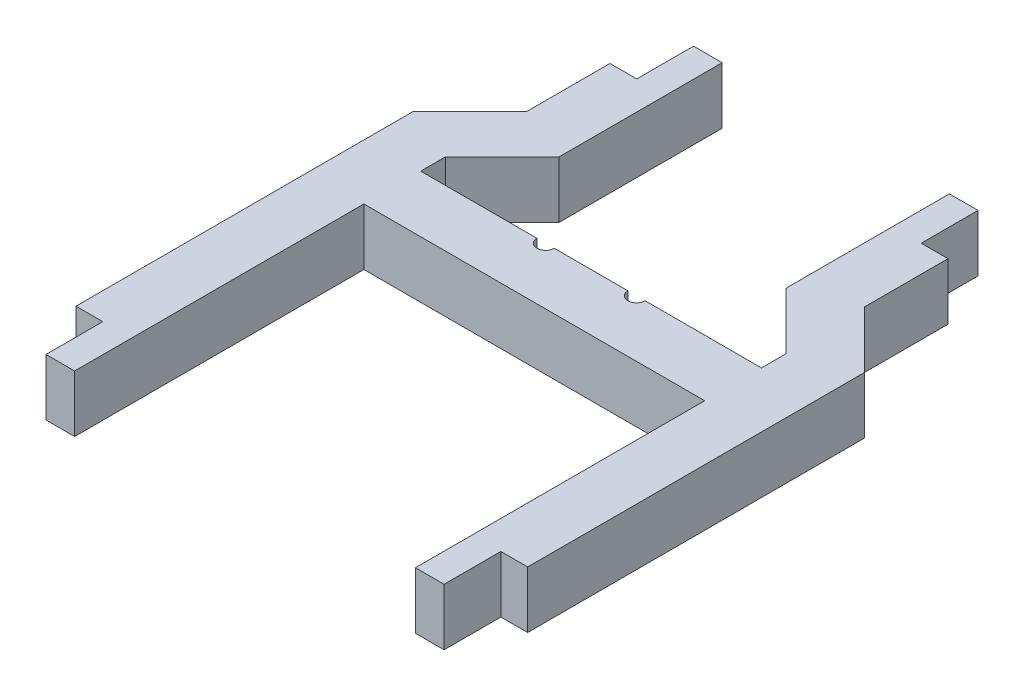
ISO-10303-21;
HEADER;
FILE_DESCRIPTION(('STEP AP214'),'2;1');
FILE_NAME('part.step','',(''),(''),'','','');
FILE_SCHEMA(('AUTOMOTIVE_DESIGN { 1 0 10303 214 1 1 1 1 }'));
ENDSEC;
DATA;
#1=APPLICATION_CONTEXT('core data for automotive mechanical design processes');
#2=APPLICATION_PROTOCOL_DEFINITION('international standard','automotive_design',2000,#1);
#3=PRODUCT_CONTEXT('',#1,'mechanical');
#4=PRODUCT('Part','Part','',(#3));
#5=PRODUCT_RELATED_PRODUCT_CATEGORY('part','',(#4));
#6=PRODUCT_DEFINITION_FORMATION('','',#4);
#7=PRODUCT_DEFINITION_CONTEXT('part definition',#1,'design');
#8=PRODUCT_DEFINITION('design','',#6,#7);
#9=PRODUCT_DEFINITION_SHAPE('','',#8);
#10=(LENGTH_UNIT() NAMED_UNIT(*) SI_UNIT(.MILLI.,.METRE.));
#11=(NAMED_UNIT(*) PLANE_ANGLE_UNIT() SI_UNIT($,.RADIAN.));
#12=(NAMED_UNIT(*) SI_UNIT($,.STERADIAN.) SOLID_ANGLE_UNIT());
#13=UNCERTAINTY_MEASURE_WITH_UNIT(LENGTH_MEASURE(1.E-05),#10,'distance_accuracy_value','');
#14=(GEOMETRIC_REPRESENTATION_CONTEXT(3) GLOBAL_UNCERTAINTY_ASSIGNED_CONTEXT((#13)) GLOBAL_UNIT_ASSIGNED_CONTEXT((#10,
#11,#12)) REPRESENTATION_CONTEXT('',''));
#15=CARTESIAN_POINT('',(0.,0.,0.));
#16=DIRECTION('',(0.,0.,1.));
#17=DIRECTION('',(1.,0.,0.));
#18=AXIS2_PLACEMENT_3D('',#15,#16,#17);
#19=CARTESIAN_POINT('',(0.,6.35,-7.62));
#20=DIRECTION('',(0.,0.,1.));
#21=DIRECTION('',(1.,0.,0.));
#22=AXIS2_PLACEMENT_3D('',#19,#20,#21);
#23=PLANE('',#22);
#24=DIRECTION('',(-1.,0.,0.));
#25=VECTOR('',#24,1.);
#26=CARTESIAN_POINT('',(0.,0.,-7.62));
#27=LINE('',#26,#25);
#28=CARTESIAN_POINT('',(-19.05,0.,-7.62));
#29=VERTEX_POINT('',#28);
#30=CARTESIAN_POINT('',(-22.2504,0.,-7.62));
#31=VERTEX_POINT('',#30);
#32=EDGE_CURVE('E272',#29,#31,#27,.T.);
#33=ORIENTED_EDGE('',*,*,#32,.F.);
#34=DIRECTION('',(0.,-1.,0.));
#35=VECTOR('',#34,1.);
#36=CARTESIAN_POINT('',(-19.05,6.35,-7.62));
#37=LINE('',#36,#35);
#38=CARTESIAN_POINT('',(-19.05,6.35,-7.62));
#39=VERTEX_POINT('',#38);
#40=EDGE_CURVE('E11',#39,#29,#37,.T.);
#41=ORIENTED_EDGE('',*,*,#40,.F.);
#42=DIRECTION('',(-1.,0.,0.));
#43=VECTOR('',#42,1.);
#44=CARTESIAN_POINT('',(0.,6.35,-7.62));
#45=LINE('',#44,#43);
#46=CARTESIAN_POINT('',(-22.2504,6.35,-7.62));
#47=VERTEX_POINT('',#46);
#48=EDGE_CURVE('E346',#39,#47,#45,.T.);
#49=ORIENTED_EDGE('',*,*,#48,.T.);
#50=DIRECTION('',(0.,-1.,0.));
#51=VECTOR('',#50,1.);
#52=CARTESIAN_POINT('',(-22.2504,6.35,-7.62));
#53=LINE('',#52,#51);
#54=EDGE_CURVE('E51',#47,#31,#53,.T.);
#55=ORIENTED_EDGE('',*,*,#54,.T.);
#56=EDGE_LOOP('',(#33,#41,#49,#55));
#57=FACE_BOUND('',#56,.T.);
#58=ADVANCED_FACE('F35',(#57),#23,.T.);
#59=CARTESIAN_POINT('',(-19.05,6.35,0.));
#60=DIRECTION('',(-1.,0.,0.));
#61=DIRECTION('',(0.,0.,1.));
#62=AXIS2_PLACEMENT_3D('',#59,#60,#61);
#63=PLANE('',#62);
#64=DIRECTION('',(0.,0.,-1.));
#65=VECTOR('',#64,1.);
#66=CARTESIAN_POINT('',(-19.05,0.,0.));
#67=LINE('',#66,#65);
#68=CARTESIAN_POINT('',(-19.05,0.,-39.9560067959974));
#69=VERTEX_POINT('',#68);
#70=EDGE_CURVE('E274',#29,#69,#67,.T.);
#71=ORIENTED_EDGE('',*,*,#70,.T.);
#72=DIRECTION('',(0.,-1.,0.));
#73=VECTOR('',#72,1.);
#74=CARTESIAN_POINT('',(-19.05,6.35,-39.9560067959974));
#75=LINE('',#74,#73);
#76=CARTESIAN_POINT('',(-19.05,6.35,-39.9560067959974));
#77=VERTEX_POINT('',#76);
#78=EDGE_CURVE('E43',#77,#69,#75,.T.);
#79=ORIENTED_EDGE('',*,*,#78,.F.);
#80=DIRECTION('',(0.,0.,-1.));
#81=VECTOR('',#80,1.);
#82=CARTESIAN_POINT('',(-19.05,6.35,0.));
#83=LINE('',#82,#81);
#84=EDGE_CURVE('E437',#39,#77,#83,.T.);
#85=ORIENTED_EDGE('',*,*,#84,.F.);
#86=ORIENTED_EDGE('',*,*,#40,.T.);
#87=EDGE_LOOP('',(#71,#79,#85,#86));
#88=FACE_BOUND('',#87,.T.);
#89=ADVANCED_FACE('F496',(#88),#63,.F.);
#90=CARTESIAN_POINT('',(0.,6.35,-39.9560067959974));
#91=DIRECTION('',(0.,0.,-1.));
#92=DIRECTION('',(-1.,0.,0.));
#93=AXIS2_PLACEMENT_3D('',#90,#91,#92);
#94=PLANE('',#93);
#95=DIRECTION('',(1.,0.,0.));
#96=VECTOR('',#95,1.);
#97=CARTESIAN_POINT('',(0.,0.,-39.9560067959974));
#98=LINE('',#97,#96);
#99=CARTESIAN_POINT('',(19.05,0.,-39.9560067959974));
#100=VERTEX_POINT('',#99);
#101=EDGE_CURVE('E276',#69,#100,#98,.T.);
#102=ORIENTED_EDGE('',*,*,#101,.T.);
#103=DIRECTION('',(0.,-1.,0.));
#104=VECTOR('',#103,1.);
#105=CARTESIAN_POINT('',(19.05,6.35,-39.9560067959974));
#106=LINE('',#105,#104);
#107=CARTESIAN_POINT('',(19.05,6.35,-39.9560067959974));
#108=VERTEX_POINT('',#107);
#109=EDGE_CURVE('E410',#108,#100,#106,.T.);
#110=ORIENTED_EDGE('',*,*,#109,.F.);
#111=DIRECTION('',(1.,0.,0.));
#112=VECTOR('',#111,1.);
#113=CARTESIAN_POINT('',(0.,6.35,-39.9560067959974));
#114=LINE('',#113,#112);
#115=EDGE_CURVE('E418',#77,#108,#114,.T.);
#116=ORIENTED_EDGE('',*,*,#115,.F.);
#117=ORIENTED_EDGE('',*,*,#78,.T.);
#118=EDGE_LOOP('',(#102,#110,#116,#117));
#119=FACE_BOUND('',#118,.T.);
#120=ADVANCED_FACE('F416',(#119),#94,.F.);
#121=CARTESIAN_POINT('',(19.05,6.35,0.));
#122=DIRECTION('',(-1.,0.,0.));
#123=DIRECTION('',(0.,0.,1.));
#124=AXIS2_PLACEMENT_3D('',#121,#122,#123);
#125=PLANE('',#124);
#126=DIRECTION('',(0.,0.,-1.));
#127=VECTOR('',#126,1.);
#128=CARTESIAN_POINT('',(19.05,0.,0.));
#129=LINE('',#128,#127);
#130=CARTESIAN_POINT('',(19.05,0.,-7.62));
#131=VERTEX_POINT('',#130);
#132=EDGE_CURVE('E280',#131,#100,#129,.T.);
#133=ORIENTED_EDGE('',*,*,#132,.F.);
#134=DIRECTION('',(0.,-1.,0.));
#135=VECTOR('',#134,1.);
#136=CARTESIAN_POINT('',(19.05,6.35,-7.62));
#137=LINE('',#136,#135);
#138=CARTESIAN_POINT('',(19.05,6.35,-7.62));
#139=VERTEX_POINT('',#138);
#140=EDGE_CURVE('E408',#139,#131,#137,.T.);
#141=ORIENTED_EDGE('',*,*,#140,.F.);
#142=DIRECTION('',(0.,0.,-1.));
#143=VECTOR('',#142,1.);
#144=CARTESIAN_POINT('',(19.05,6.35,0.));
#145=LINE('',#144,#143);
#146=EDGE_CURVE('E431',#139,#108,#145,.T.);
#147=ORIENTED_EDGE('',*,*,#146,.T.);
#148=ORIENTED_EDGE('',*,*,#109,.T.);
#149=EDGE_LOOP('',(#133,#141,#147,#148));
#150=FACE_BOUND('',#149,.T.);
#151=ADVANCED_FACE('F427',(#150),#125,.T.);
#152=CARTESIAN_POINT('',(0.,6.35,-7.62));
#153=DIRECTION('',(0.,0.,-1.));
#154=DIRECTION('',(-1.,0.,0.));
#155=AXIS2_PLACEMENT_3D('',#152,#153,#154);
#156=PLANE('',#155);
#157=DIRECTION('',(1.,0.,0.));
#158=VECTOR('',#157,1.);
#159=CARTESIAN_POINT('',(0.,0.,-7.62));
#160=LINE('',#159,#158);
#161=CARTESIAN_POINT('',(22.2504,0.,-7.62));
#162=VERTEX_POINT('',#161);
#163=EDGE_CURVE('E283',#131,#162,#160,.T.);
#164=ORIENTED_EDGE('',*,*,#163,.T.);
#165=DIRECTION('',(0.,-1.,0.));
#166=VECTOR('',#165,1.);
#167=CARTESIAN_POINT('',(22.2504,6.35,-7.62));
#168=LINE('',#167,#166);
#169=CARTESIAN_POINT('',(22.2504,6.35,-7.62));
#170=VERTEX_POINT('',#169);
#171=EDGE_CURVE('E405',#170,#162,#168,.T.);
#172=ORIENTED_EDGE('',*,*,#171,.F.);
#173=DIRECTION('',(1.,0.,0.));
#174=VECTOR('',#173,1.);
#175=CARTESIAN_POINT('',(0.,6.35,-7.62));
#176=LINE('',#175,#174);
#177=EDGE_CURVE('E432',#139,#170,#176,.T.);
#178=ORIENTED_EDGE('',*,*,#177,.F.);
#179=ORIENTED_EDGE('',*,*,#140,.T.);
#180=EDGE_LOOP('',(#164,#172,#178,#179));
#181=FACE_BOUND('',#180,.T.);
#182=ADVANCED_FACE('F609',(#181),#156,.F.);
#183=CARTESIAN_POINT('',(22.2504,6.35,0.));
#184=DIRECTION('',(-1.,0.,0.));
#185=DIRECTION('',(0.,0.,1.));
#186=AXIS2_PLACEMENT_3D('',#183,#184,#185);
#187=PLANE('',#186);
#188=DIRECTION('',(0.,0.,-1.));
#189=VECTOR('',#188,1.);
#190=CARTESIAN_POINT('',(22.2504,0.,0.));
#191=LINE('',#190,#189);
#192=CARTESIAN_POINT('',(22.2504,0.,-13.97));
#193=VERTEX_POINT('',#192);
#194=EDGE_CURVE('E286',#162,#193,#191,.T.);
#195=ORIENTED_EDGE('',*,*,#194,.T.);
#196=DIRECTION('',(0.,-1.,0.));
#197=VECTOR('',#196,1.);
#198=CARTESIAN_POINT('',(22.2504,6.35,-13.97));
#199=LINE('',#198,#197);
#200=CARTESIAN_POINT('',(22.2504,6.35,-13.97));
#201=VERTEX_POINT('',#200);
#202=EDGE_CURVE('E402',#201,#193,#199,.T.);
#203=ORIENTED_EDGE('',*,*,#202,.F.);
#204=DIRECTION('',(0.,0.,-1.));
#205=VECTOR('',#204,1.);
#206=CARTESIAN_POINT('',(22.2504,6.35,0.));
#207=LINE('',#206,#205);
#208=EDGE_CURVE('E435',#170,#201,#207,.T.);
#209=ORIENTED_EDGE('',*,*,#208,.F.);
#210=ORIENTED_EDGE('',*,*,#171,.T.);
#211=EDGE_LOOP('',(#195,#203,#209,#210));
#212=FACE_BOUND('',#211,.T.);
#213=ADVANCED_FACE('F605',(#212),#187,.F.);
#214=CARTESIAN_POINT('',(0.,6.35,-13.97));
#215=DIRECTION('',(0.,0.,-1.));
#216=DIRECTION('',(-1.,0.,0.));
#217=AXIS2_PLACEMENT_3D('',#214,#215,#216);
#218=PLANE('',#217);
#219=DIRECTION('',(1.,0.,0.));
#220=VECTOR('',#219,1.);
#221=CARTESIAN_POINT('',(0.,0.,-13.97));
#222=LINE('',#221,#220);
#223=CARTESIAN_POINT('',(25.2476,0.,-13.97));
#224=VERTEX_POINT('',#223);
#225=EDGE_CURVE('E288',#193,#224,#222,.T.);
#226=ORIENTED_EDGE('',*,*,#225,.T.);
#227=DIRECTION('',(0.,-1.,0.));
#228=VECTOR('',#227,1.);
#229=CARTESIAN_POINT('',(25.2476,6.35,-13.97));
#230=LINE('',#229,#228);
#231=CARTESIAN_POINT('',(25.2476,6.35,-13.97));
#232=VERTEX_POINT('',#231);
#233=EDGE_CURVE('E399',#232,#224,#230,.T.);
#234=ORIENTED_EDGE('',*,*,#233,.F.);
#235=DIRECTION('',(1.,0.,0.));
#236=VECTOR('',#235,1.);
#237=CARTESIAN_POINT('',(0.,6.35,-13.97));
#238=LINE('',#237,#236);
#239=EDGE_CURVE('E629',#201,#232,#238,.T.);
#240=ORIENTED_EDGE('',*,*,#239,.F.);
#241=ORIENTED_EDGE('',*,*,#202,.T.);
#242=EDGE_LOOP('',(#226,#234,#240,#241));
#243=FACE_BOUND('',#242,.T.);
#244=ADVANCED_FACE('F601',(#243),#218,.F.);
#245=CARTESIAN_POINT('',(25.2476,6.35,0.));
#246=DIRECTION('',(-1.,0.,0.));
#247=DIRECTION('',(0.,0.,1.));
#248=AXIS2_PLACEMENT_3D('',#245,#246,#247);
#249=PLANE('',#248);
#250=DIRECTION('',(0.,0.,-1.));
#251=VECTOR('',#250,1.);
#252=CARTESIAN_POINT('',(25.2476,0.,0.));
#253=LINE('',#252,#251);
#254=CARTESIAN_POINT('',(25.2476,0.,-51.6382351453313));
#255=VERTEX_POINT('',#254);
#256=EDGE_CURVE('E290',#224,#255,#253,.T.);
#257=ORIENTED_EDGE('',*,*,#256,.T.);
#258=DIRECTION('',(0.,-1.,0.));
#259=VECTOR('',#258,1.);
#260=CARTESIAN_POINT('',(25.2476,6.35,-51.6382351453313));
#261=LINE('',#260,#259);
#262=CARTESIAN_POINT('',(25.2476,6.35,-51.6382351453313));
#263=VERTEX_POINT('',#262);
#264=EDGE_CURVE('E397',#263,#255,#261,.T.);
#265=ORIENTED_EDGE('',*,*,#264,.F.);
#266=DIRECTION('',(0.,0.,-1.));
#267=VECTOR('',#266,1.);
#268=CARTESIAN_POINT('',(25.2476,6.35,0.));
#269=LINE('',#268,#267);
#270=EDGE_CURVE('E625',#232,#263,#269,.T.);
#271=ORIENTED_EDGE('',*,*,#270,.F.);
#272=ORIENTED_EDGE('',*,*,#233,.T.);
#273=EDGE_LOOP('',(#257,#265,#271,#272));
#274=FACE_BOUND('',#273,.T.);
#275=ADVANCED_FACE('F597',(#274),#249,.F.);
#276=CARTESIAN_POINT('',(38.4429175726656,6.35,-38.4429175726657));
#277=DIRECTION('',(0.707106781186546,0.,-0.707106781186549));
#278=DIRECTION('',(-0.707106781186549,0.,-0.707106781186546));
#279=AXIS2_PLACEMENT_3D('',#276,#277,#278);
#280=PLANE('',#279);
#281=DIRECTION('',(0.707106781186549,0.,0.707106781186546));
#282=VECTOR('',#281,1.);
#283=CARTESIAN_POINT('',(38.4429175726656,0.,-38.4429175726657));
#284=LINE('',#283,#282);
#285=CARTESIAN_POINT('',(18.8976,0.,-57.9882351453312));
#286=VERTEX_POINT('',#285);
#287=EDGE_CURVE('E293',#286,#255,#284,.T.);
#288=ORIENTED_EDGE('',*,*,#287,.F.);
#289=DIRECTION('',(0.,-1.,0.));
#290=VECTOR('',#289,1.);
#291=CARTESIAN_POINT('',(18.8976,6.35,-57.9882351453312));
#292=LINE('',#291,#290);
#293=CARTESIAN_POINT('',(18.8976,6.35,-57.9882351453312));
#294=VERTEX_POINT('',#293);
#295=EDGE_CURVE('E395',#294,#286,#292,.T.);
#296=ORIENTED_EDGE('',*,*,#295,.F.);
#297=DIRECTION('',(0.707106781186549,0.,0.707106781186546));
#298=VECTOR('',#297,1.);
#299=CARTESIAN_POINT('',(38.4429175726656,6.35,-38.4429175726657));
#300=LINE('',#299,#298);
#301=EDGE_CURVE('E628',#294,#263,#300,.T.);
#302=ORIENTED_EDGE('',*,*,#301,.T.);
#303=ORIENTED_EDGE('',*,*,#264,.T.);
#304=EDGE_LOOP('',(#288,#296,#302,#303));
#305=FACE_BOUND('',#304,.T.);
#306=ADVANCED_FACE('F593',(#305),#280,.T.);
#307=CARTESIAN_POINT('',(18.8976,6.35,0.));
#308=DIRECTION('',(1.,0.,0.));
#309=DIRECTION('',(0.,0.,-1.));
#310=AXIS2_PLACEMENT_3D('',#307,#308,#309);
#311=PLANE('',#310);
#312=DIRECTION('',(0.,0.,1.));
#313=VECTOR('',#312,1.);
#314=CARTESIAN_POINT('',(18.8976,0.,0.));
#315=LINE('',#314,#313);
#316=CARTESIAN_POINT('',(18.8976,0.,-67.31));
#317=VERTEX_POINT('',#316);
#318=EDGE_CURVE('E296',#317,#286,#315,.T.);
#319=ORIENTED_EDGE('',*,*,#318,.F.);
#320=DIRECTION('',(0.,-1.,0.));
#321=VECTOR('',#320,1.);
#322=CARTESIAN_POINT('',(18.8976,6.35,-67.31));
#323=LINE('',#322,#321);
#324=CARTESIAN_POINT('',(18.8976,6.35,-67.31));
#325=VERTEX_POINT('',#324);
#326=EDGE_CURVE('E393',#325,#317,#323,.T.);
#327=ORIENTED_EDGE('',*,*,#326,.F.);
#328=DIRECTION('',(0.,0.,1.));
#329=VECTOR('',#328,1.);
#330=CARTESIAN_POINT('',(18.8976,6.35,0.));
#331=LINE('',#330,#329);
#332=EDGE_CURVE('E631',#325,#294,#331,.T.);
#333=ORIENTED_EDGE('',*,*,#332,.T.);
#334=ORIENTED_EDGE('',*,*,#295,.T.);
#335=EDGE_LOOP('',(#319,#327,#333,#334));
#336=FACE_BOUND('',#335,.T.);
#337=ADVANCED_FACE('F589',(#336),#311,.T.);
#338=CARTESIAN_POINT('',(0.,6.35,-67.31));
#339=DIRECTION('',(0.,0.,-1.));
#340=DIRECTION('',(-1.,0.,0.));
#341=AXIS2_PLACEMENT_3D('',#338,#339,#340);
#342=PLANE('',#341);
#343=DIRECTION('',(1.,0.,0.));
#344=VECTOR('',#343,1.);
#345=CARTESIAN_POINT('',(0.,0.,-67.31));
#346=LINE('',#345,#344);
#347=CARTESIAN_POINT('',(15.9004,0.,-67.31));
#348=VERTEX_POINT('',#347);
#349=EDGE_CURVE('E299',#348,#317,#346,.T.);
#350=ORIENTED_EDGE('',*,*,#349,.F.);
#351=DIRECTION('',(0.,-1.,0.));
#352=VECTOR('',#351,1.);
#353=CARTESIAN_POINT('',(15.9004,6.35,-67.31));
#354=LINE('',#353,#352);
#355=CARTESIAN_POINT('',(15.9004,6.35,-67.31));
#356=VERTEX_POINT('',#355);
#357=EDGE_CURVE('E391',#356,#348,#354,.T.);
#358=ORIENTED_EDGE('',*,*,#357,.F.);
#359=DIRECTION('',(1.,0.,0.));
#360=VECTOR('',#359,1.);
#361=CARTESIAN_POINT('',(0.,6.35,-67.31));
#362=LINE('',#361,#360);
#363=EDGE_CURVE('E638',#356,#325,#362,.T.);
#364=ORIENTED_EDGE('',*,*,#363,.T.);
#365=ORIENTED_EDGE('',*,*,#326,.T.);
#366=EDGE_LOOP('',(#350,#358,#364,#365));
#367=FACE_BOUND('',#366,.T.);
#368=ADVANCED_FACE('F585',(#367),#342,.T.);
#369=CARTESIAN_POINT('',(15.9004,6.35,0.));
#370=DIRECTION('',(1.,0.,0.));
#371=DIRECTION('',(0.,0.,-1.));
#372=AXIS2_PLACEMENT_3D('',#369,#370,#371);
#373=PLANE('',#372);
#374=DIRECTION('',(0.,0.,1.));
#375=VECTOR('',#374,1.);
#376=CARTESIAN_POINT('',(15.9004,0.,0.));
#377=LINE('',#376,#375);
#378=CARTESIAN_POINT('',(15.9004,0.,-73.66));
#379=VERTEX_POINT('',#378);
#380=EDGE_CURVE('E302',#379,#348,#377,.T.);
#381=ORIENTED_EDGE('',*,*,#380,.F.);
#382=DIRECTION('',(0.,-1.,0.));
#383=VECTOR('',#382,1.);
#384=CARTESIAN_POINT('',(15.9004,6.35,-73.66));
#385=LINE('',#384,#383);
#386=CARTESIAN_POINT('',(15.9004,6.35,-73.66));
#387=VERTEX_POINT('',#386);
#388=EDGE_CURVE('E389',#387,#379,#385,.T.);
#389=ORIENTED_EDGE('',*,*,#388,.F.);
#390=DIRECTION('',(0.,0.,1.));
#391=VECTOR('',#390,1.);
#392=CARTESIAN_POINT('',(15.9004,6.35,0.));
#393=LINE('',#392,#391);
#394=EDGE_CURVE('E641',#387,#356,#393,.T.);
#395=ORIENTED_EDGE('',*,*,#394,.T.);
#396=ORIENTED_EDGE('',*,*,#357,.T.);
#397=EDGE_LOOP('',(#381,#389,#395,#396));
#398=FACE_BOUND('',#397,.T.);
#399=ADVANCED_FACE('F581',(#398),#373,.T.);
#400=CARTESIAN_POINT('',(0.,6.35,-73.66));
#401=DIRECTION('',(0.,0.,-1.));
#402=DIRECTION('',(-1.,0.,0.));
#403=AXIS2_PLACEMENT_3D('',#400,#401,#402);
#404=PLANE('',#403);
#405=DIRECTION('',(1.,0.,0.));
#406=VECTOR('',#405,1.);
#407=CARTESIAN_POINT('',(0.,0.,-73.66));
#408=LINE('',#407,#406);
#409=CARTESIAN_POINT('',(12.7,0.,-73.66));
#410=VERTEX_POINT('',#409);
#411=EDGE_CURVE('E305',#410,#379,#408,.T.);
#412=ORIENTED_EDGE('',*,*,#411,.F.);
#413=DIRECTION('',(0.,-1.,0.));
#414=VECTOR('',#413,1.);
#415=CARTESIAN_POINT('',(12.7,6.35,-73.66));
#416=LINE('',#415,#414);
#417=CARTESIAN_POINT('',(12.7,6.35,-73.66));
#418=VERTEX_POINT('',#417);
#419=EDGE_CURVE('E387',#418,#410,#416,.T.);
#420=ORIENTED_EDGE('',*,*,#419,.F.);
#421=DIRECTION('',(1.,0.,0.));
#422=VECTOR('',#421,1.);
#423=CARTESIAN_POINT('',(0.,6.35,-73.66));
#424=LINE('',#423,#422);
#425=EDGE_CURVE('E455',#418,#387,#424,.T.);
#426=ORIENTED_EDGE('',*,*,#425,.T.);
#427=ORIENTED_EDGE('',*,*,#388,.T.);
#428=EDGE_LOOP('',(#412,#420,#426,#427));
#429=FACE_BOUND('',#428,.T.);
#430=ADVANCED_FACE('F577',(#429),#404,.T.);
#431=CARTESIAN_POINT('',(12.7,6.35,0.));
#432=DIRECTION('',(-1.,0.,0.));
#433=DIRECTION('',(0.,0.,1.));
#434=AXIS2_PLACEMENT_3D('',#431,#432,#433);
#435=PLANE('',#434);
#436=DIRECTION('',(0.,0.,-1.));
#437=VECTOR('',#436,1.);
#438=CARTESIAN_POINT('',(12.7,0.,0.));
#439=LINE('',#438,#437);
#440=CARTESIAN_POINT('',(12.7,0.,-55.4211051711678));
#441=VERTEX_POINT('',#440);
#442=EDGE_CURVE('E308',#441,#410,#439,.T.);
#443=ORIENTED_EDGE('',*,*,#442,.F.);
#444=DIRECTION('',(0.,-1.,0.));
#445=VECTOR('',#444,1.);
#446=CARTESIAN_POINT('',(12.7,6.35,-55.4211051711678));
#447=LINE('',#446,#445);
#448=CARTESIAN_POINT('',(12.7,6.35,-55.4211051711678));
#449=VERTEX_POINT('',#448);
#450=EDGE_CURVE('E385',#449,#441,#447,.T.);
#451=ORIENTED_EDGE('',*,*,#450,.F.);
#452=DIRECTION('',(0.,0.,-1.));
#453=VECTOR('',#452,1.);
#454=CARTESIAN_POINT('',(12.7,6.35,0.));
#455=LINE('',#454,#453);
#456=EDGE_CURVE('E450',#449,#418,#455,.T.);
#457=ORIENTED_EDGE('',*,*,#456,.T.);
#458=ORIENTED_EDGE('',*,*,#419,.T.);
#459=EDGE_LOOP('',(#443,#451,#457,#458));
#460=FACE_BOUND('',#459,.T.);
#461=ADVANCED_FACE('F574',(#460),#435,.T.);
#462=CARTESIAN_POINT('',(34.0605525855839,6.35,-34.060552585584));
#463=DIRECTION('',(-0.707106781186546,0.,0.707106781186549));
#464=DIRECTION('',(0.707106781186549,0.,0.707106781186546));
#465=AXIS2_PLACEMENT_3D('',#462,#463,#464);
#466=PLANE('',#465);
#467=DIRECTION('',(-0.707106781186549,0.,-0.707106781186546));
#468=VECTOR('',#467,1.);
#469=CARTESIAN_POINT('',(34.0605525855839,0.,-34.060552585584));
#470=LINE('',#469,#468);
#471=CARTESIAN_POINT('',(19.05,0.,-49.0711051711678));
#472=VERTEX_POINT('',#471);
#473=EDGE_CURVE('E311',#472,#441,#470,.T.);
#474=ORIENTED_EDGE('',*,*,#473,.F.);
#475=DIRECTION('',(0.,-1.,0.));
#476=VECTOR('',#475,1.);
#477=CARTESIAN_POINT('',(19.05,6.35,-49.0711051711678));
#478=LINE('',#477,#476);
#479=CARTESIAN_POINT('',(19.05,6.35,-49.0711051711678));
#480=VERTEX_POINT('',#479);
#481=EDGE_CURVE('E383',#480,#472,#478,.T.);
#482=ORIENTED_EDGE('',*,*,#481,.F.);
#483=DIRECTION('',(-0.707106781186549,0.,-0.707106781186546));
#484=VECTOR('',#483,1.);
#485=CARTESIAN_POINT('',(34.0605525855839,6.35,-34.060552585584));
#486=LINE('',#485,#484);
#487=EDGE_CURVE('E441',#480,#449,#486,.T.);
#488=ORIENTED_EDGE('',*,*,#487,.T.);
#489=ORIENTED_EDGE('',*,*,#450,.T.);
#490=EDGE_LOOP('',(#474,#482,#488,#489));
#491=FACE_BOUND('',#490,.T.);
#492=ADVANCED_FACE('F571',(#491),#466,.T.);
#493=CARTESIAN_POINT('',(19.05,0.,-46.3060067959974));
#494=VERTEX_POINT('',#493);
#495=EDGE_CURVE('E284',#494,#472,#129,.T.);
#496=ORIENTED_EDGE('',*,*,#495,.F.);
#497=DIRECTION('',(0.,-1.,0.));
#498=VECTOR('',#497,1.);
#499=CARTESIAN_POINT('',(19.05,6.35,-46.3060067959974));
#500=LINE('',#499,#498);
#501=CARTESIAN_POINT('',(19.05,6.35,-46.3060067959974));
#502=VERTEX_POINT('',#501);
#503=EDGE_CURVE('E381',#502,#494,#500,.T.);
#504=ORIENTED_EDGE('',*,*,#503,.F.);
#505=EDGE_CURVE('E434',#502,#480,#145,.T.);
#506=ORIENTED_EDGE('',*,*,#505,.T.);
#507=ORIENTED_EDGE('',*,*,#481,.T.);
#508=EDGE_LOOP('',(#496,#504,#506,#507));
#509=FACE_BOUND('',#508,.T.);
#510=ADVANCED_FACE('F568',(#509),#125,.T.);
#511=CARTESIAN_POINT('',(0.,6.35,-46.3060067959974));
#512=DIRECTION('',(0.,0.,-1.));
#513=DIRECTION('',(-1.,0.,0.));
#514=AXIS2_PLACEMENT_3D('',#511,#512,#513);
#515=PLANE('',#514);
#516=DIRECTION('',(1.,0.,0.));
#517=VECTOR('',#516,1.);
#518=CARTESIAN_POINT('',(0.,0.,-46.3060067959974));
#519=LINE('',#518,#517);
#520=CARTESIAN_POINT('',(6.04601611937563,0.,-46.3060067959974));
#521=VERTEX_POINT('',#520);
#522=EDGE_CURVE('E314',#521,#494,#519,.T.);
#523=ORIENTED_EDGE('',*,*,#522,.F.);
#524=DIRECTION('',(0.,-1.,0.));
#525=VECTOR('',#524,1.);
#526=CARTESIAN_POINT('',(6.04601611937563,6.35,-46.3060067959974));
#527=LINE('',#526,#525);
#528=CARTESIAN_POINT('',(6.04601611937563,6.35,-46.3060067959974));
#529=VERTEX_POINT('',#528);
#530=EDGE_CURVE('E379',#529,#521,#527,.T.);
#531=ORIENTED_EDGE('',*,*,#530,.F.);
#532=DIRECTION('',(1.,0.,0.));
#533=VECTOR('',#532,1.);
#534=CARTESIAN_POINT('',(0.,6.35,-46.3060067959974));
#535=LINE('',#534,#533);
#536=EDGE_CURVE('E440',#529,#502,#535,.T.);
#537=ORIENTED_EDGE('',*,*,#536,.T.);
#538=ORIENTED_EDGE('',*,*,#503,.T.);
#539=EDGE_LOOP('',(#523,#531,#537,#538));
#540=FACE_BOUND('',#539,.T.);
#541=ADVANCED_FACE('F519',(#540),#515,.T.);
#542=CARTESIAN_POINT('',(5.08,6.35,-46.3060067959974));
#543=DIRECTION('',(0.,-1.,0.));
#544=DIRECTION('',(0.,0.,-1.));
#545=AXIS2_PLACEMENT_3D('',#542,#543,#544);
#546=CYLINDRICAL_SURFACE('',#545,0.966016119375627);
#547=CARTESIAN_POINT('',(5.08,0.,-46.3060067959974));
#548=DIRECTION('',(0.,1.,0.));
#549=DIRECTION('',(0.,0.,1.));
#550=AXIS2_PLACEMENT_3D('',#547,#548,#549);
#551=CIRCLE('',#550,0.966016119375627);
#552=CARTESIAN_POINT('',(4.11398388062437,0.,-46.3060067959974));
#553=VERTEX_POINT('',#552);
#554=EDGE_CURVE('E317',#553,#521,#551,.T.);
#555=ORIENTED_EDGE('',*,*,#554,.F.);
#556=DIRECTION('',(0.,-1.,0.));
#557=VECTOR('',#556,1.);
#558=CARTESIAN_POINT('',(4.11398388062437,6.35,-46.3060067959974));
#559=LINE('',#558,#557);
#560=CARTESIAN_POINT('',(4.11398388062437,6.35,-46.3060067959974));
#561=VERTEX_POINT('',#560);
#562=EDGE_CURVE('E377',#561,#553,#559,.T.);
#563=ORIENTED_EDGE('',*,*,#562,.F.);
#564=CARTESIAN_POINT('',(5.08,6.35,-46.3060067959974));
#565=DIRECTION('',(0.,1.,0.));
#566=DIRECTION('',(0.,0.,1.));
#567=AXIS2_PLACEMENT_3D('',#564,#565,#566);
#568=CIRCLE('',#567,0.966016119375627);
#569=EDGE_CURVE('E445',#561,#529,#568,.T.);
#570=ORIENTED_EDGE('',*,*,#569,.T.);
#571=ORIENTED_EDGE('',*,*,#530,.T.);
#572=EDGE_LOOP('',(#555,#563,#570,#571));
#573=FACE_BOUND('',#572,.T.);
#574=ADVANCED_FACE('F555',(#573),#546,.F.);
#575=CARTESIAN_POINT('',(-4.11398388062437,0.,-46.3060067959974));
#576=VERTEX_POINT('',#575);
#577=EDGE_CURVE('E319',#576,#553,#519,.T.);
#578=ORIENTED_EDGE('',*,*,#577,.F.);
#579=DIRECTION('',(0.,-1.,0.));
#580=VECTOR('',#579,1.);
#581=CARTESIAN_POINT('',(-4.11398388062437,6.35,-46.3060067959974));
#582=LINE('',#581,#580);
#583=CARTESIAN_POINT('',(-4.11398388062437,6.35,-46.3060067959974));
#584=VERTEX_POINT('',#583);
#585=EDGE_CURVE('E375',#584,#576,#582,.T.);
#586=ORIENTED_EDGE('',*,*,#585,.F.);
#587=EDGE_CURVE('E448',#584,#561,#535,.T.);
#588=ORIENTED_EDGE('',*,*,#587,.T.);
#589=ORIENTED_EDGE('',*,*,#562,.T.);
#590=EDGE_LOOP('',(#578,#586,#588,#589));
#591=FACE_BOUND('',#590,.T.);
#592=ADVANCED_FACE('F520',(#591),#515,.T.);
#593=CARTESIAN_POINT('',(-5.08,6.35,-46.3060067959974));
#594=DIRECTION('',(0.,-1.,0.));
#595=DIRECTION('',(0.,0.,-1.));
#596=AXIS2_PLACEMENT_3D('',#593,#594,#595);
#597=CYLINDRICAL_SURFACE('',#596,0.966016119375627);
#598=CARTESIAN_POINT('',(-5.08,0.,-46.3060067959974));
#599=DIRECTION('',(0.,1.,0.));
#600=DIRECTION('',(0.,0.,1.));
#601=AXIS2_PLACEMENT_3D('',#598,#599,#600);
#602=CIRCLE('',#601,0.966016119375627);
#603=CARTESIAN_POINT('',(-6.04601611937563,0.,-46.3060067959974));
#604=VERTEX_POINT('',#603);
#605=EDGE_CURVE('E322',#576,#604,#602,.F.);
#606=ORIENTED_EDGE('',*,*,#605,.T.);
#607=DIRECTION('',(0.,-1.,0.));
#608=VECTOR('',#607,1.);
#609=CARTESIAN_POINT('',(-6.04601611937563,6.35,-46.3060067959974));
#610=LINE('',#609,#608);
#611=CARTESIAN_POINT('',(-6.04601611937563,6.35,-46.3060067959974));
#612=VERTEX_POINT('',#611);
#613=EDGE_CURVE('E373',#612,#604,#610,.T.);
#614=ORIENTED_EDGE('',*,*,#613,.F.);
#615=CARTESIAN_POINT('',(-5.08,6.35,-46.3060067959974));
#616=DIRECTION('',(0.,1.,0.));
#617=DIRECTION('',(0.,0.,1.));
#618=AXIS2_PLACEMENT_3D('',#615,#616,#617);
#619=CIRCLE('',#618,0.966016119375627);
#620=EDGE_CURVE('E461',#584,#612,#619,.F.);
#621=ORIENTED_EDGE('',*,*,#620,.F.);
#622=ORIENTED_EDGE('',*,*,#585,.T.);
#623=EDGE_LOOP('',(#606,#614,#621,#622));
#624=FACE_BOUND('',#623,.T.);
#625=ADVANCED_FACE('F517',(#624),#597,.F.);
#626=CARTESIAN_POINT('',(-19.05,0.,-46.3060067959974));
#627=VERTEX_POINT('',#626);
#628=EDGE_CURVE('E318',#627,#604,#519,.T.);
#629=ORIENTED_EDGE('',*,*,#628,.F.);
#630=DIRECTION('',(0.,-1.,0.));
#631=VECTOR('',#630,1.);
#632=CARTESIAN_POINT('',(-19.05,6.35,-46.3060067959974));
#633=LINE('',#632,#631);
#634=CARTESIAN_POINT('',(-19.05,6.35,-46.3060067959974));
#635=VERTEX_POINT('',#634);
#636=EDGE_CURVE('E371',#635,#627,#633,.T.);
#637=ORIENTED_EDGE('',*,*,#636,.F.);
#638=EDGE_CURVE('E447',#635,#612,#535,.T.);
#639=ORIENTED_EDGE('',*,*,#638,.T.);
#640=ORIENTED_EDGE('',*,*,#613,.T.);
#641=EDGE_LOOP('',(#629,#637,#639,#640));
#642=FACE_BOUND('',#641,.T.);
#643=ADVANCED_FACE('F509',(#642),#515,.T.);
#644=CARTESIAN_POINT('',(-19.05,0.,-49.0711051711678));
#645=VERTEX_POINT('',#644);
#646=EDGE_CURVE('E277',#627,#645,#67,.T.);
#647=ORIENTED_EDGE('',*,*,#646,.T.);
#648=DIRECTION('',(0.,-1.,0.));
#649=VECTOR('',#648,1.);
#650=CARTESIAN_POINT('',(-19.05,6.35,-49.0711051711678));
#651=LINE('',#650,#649);
#652=CARTESIAN_POINT('',(-19.05,6.35,-49.0711051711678));
#653=VERTEX_POINT('',#652);
#654=EDGE_CURVE('E368',#653,#645,#651,.T.);
#655=ORIENTED_EDGE('',*,*,#654,.F.);
#656=EDGE_CURVE('E466',#635,#653,#83,.T.);
#657=ORIENTED_EDGE('',*,*,#656,.F.);
#658=ORIENTED_EDGE('',*,*,#636,.T.);
#659=EDGE_LOOP('',(#647,#655,#657,#658));
#660=FACE_BOUND('',#659,.T.);
#661=ADVANCED_FACE('F501',(#660),#63,.F.);
#662=CARTESIAN_POINT('',(-34.0605525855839,6.35,-34.060552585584));
#663=DIRECTION('',(-0.707106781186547,0.,-0.707106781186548));
#664=DIRECTION('',(-0.707106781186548,0.,0.707106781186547));
#665=AXIS2_PLACEMENT_3D('',#662,#663,#664);
#666=PLANE('',#665);
#667=DIRECTION('',(0.707106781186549,0.,-0.707106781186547));
#668=VECTOR('',#667,1.);
#669=CARTESIAN_POINT('',(-34.0605525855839,0.,-34.060552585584));
#670=LINE('',#669,#668);
#671=CARTESIAN_POINT('',(-12.7,0.,-55.4211051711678));
#672=VERTEX_POINT('',#671);
#673=EDGE_CURVE('E325',#645,#672,#670,.T.);
#674=ORIENTED_EDGE('',*,*,#673,.T.);
#675=DIRECTION('',(0.,-1.,0.));
#676=VECTOR('',#675,1.);
#677=CARTESIAN_POINT('',(-12.7,6.35,-55.4211051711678));
#678=LINE('',#677,#676);
#679=CARTESIAN_POINT('',(-12.7,6.35,-55.4211051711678));
#680=VERTEX_POINT('',#679);
#681=EDGE_CURVE('E365',#680,#672,#678,.T.);
#682=ORIENTED_EDGE('',*,*,#681,.F.);
#683=DIRECTION('',(0.707106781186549,0.,-0.707106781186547));
#684=VECTOR('',#683,1.);
#685=CARTESIAN_POINT('',(-34.0605525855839,6.35,-34.060552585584));
#686=LINE('',#685,#684);
#687=EDGE_CURVE('E463',#653,#680,#686,.T.);
#688=ORIENTED_EDGE('',*,*,#687,.F.);
#689=ORIENTED_EDGE('',*,*,#654,.T.);
#690=EDGE_LOOP('',(#674,#682,#688,#689));
#691=FACE_BOUND('',#690,.T.);
#692=ADVANCED_FACE('F508',(#691),#666,.F.);
#693=CARTESIAN_POINT('',(-12.7,6.35,0.));
#694=DIRECTION('',(-1.,0.,0.));
#695=DIRECTION('',(0.,0.,1.));
#696=AXIS2_PLACEMENT_3D('',#693,#694,#695);
#697=PLANE('',#696);
#698=DIRECTION('',(0.,0.,-1.));
#699=VECTOR('',#698,1.);
#700=CARTESIAN_POINT('',(-12.7,0.,0.));
#701=LINE('',#700,#699);
#702=CARTESIAN_POINT('',(-12.7,0.,-73.66));
#703=VERTEX_POINT('',#702);
#704=EDGE_CURVE('E327',#672,#703,#701,.T.);
#705=ORIENTED_EDGE('',*,*,#704,.T.);
#706=DIRECTION('',(0.,-1.,0.));
#707=VECTOR('',#706,1.);
#708=CARTESIAN_POINT('',(-12.7,6.35,-73.66));
#709=LINE('',#708,#707);
#710=CARTESIAN_POINT('',(-12.7,6.35,-73.66));
#711=VERTEX_POINT('',#710);
#712=EDGE_CURVE('E362',#711,#703,#709,.T.);
#713=ORIENTED_EDGE('',*,*,#712,.F.);
#714=DIRECTION('',(0.,0.,-1.));
#715=VECTOR('',#714,1.);
#716=CARTESIAN_POINT('',(-12.7,6.35,0.));
#717=LINE('',#716,#715);
#718=EDGE_CURVE('E465',#680,#711,#717,.T.);
#719=ORIENTED_EDGE('',*,*,#718,.F.);
#720=ORIENTED_EDGE('',*,*,#681,.T.);
#721=EDGE_LOOP('',(#705,#713,#719,#720));
#722=FACE_BOUND('',#721,.T.);
#723=ADVANCED_FACE('F515',(#722),#697,.F.);
#724=CARTESIAN_POINT('',(0.,6.35,-73.66));
#725=DIRECTION('',(0.,0.,1.));
#726=DIRECTION('',(1.,0.,0.));
#727=AXIS2_PLACEMENT_3D('',#724,#725,#726);
#728=PLANE('',#727);
#729=DIRECTION('',(-1.,0.,0.));
#730=VECTOR('',#729,1.);
#731=CARTESIAN_POINT('',(0.,0.,-73.66));
#732=LINE('',#731,#730);
#733=CARTESIAN_POINT('',(-15.9004,0.,-73.66));
#734=VERTEX_POINT('',#733);
#735=EDGE_CURVE('E329',#703,#734,#732,.T.);
#736=ORIENTED_EDGE('',*,*,#735,.T.);
#737=DIRECTION('',(0.,-1.,0.));
#738=VECTOR('',#737,1.);
#739=CARTESIAN_POINT('',(-15.9004,6.35,-73.66));
#740=LINE('',#739,#738);
#741=CARTESIAN_POINT('',(-15.9004,6.35,-73.66));
#742=VERTEX_POINT('',#741);
#743=EDGE_CURVE('E359',#742,#734,#740,.T.);
#744=ORIENTED_EDGE('',*,*,#743,.F.);
#745=DIRECTION('',(-1.,0.,0.));
#746=VECTOR('',#745,1.);
#747=CARTESIAN_POINT('',(0.,6.35,-73.66));
#748=LINE('',#747,#746);
#749=EDGE_CURVE('E468',#711,#742,#748,.T.);
#750=ORIENTED_EDGE('',*,*,#749,.F.);
#751=ORIENTED_EDGE('',*,*,#712,.T.);
#752=EDGE_LOOP('',(#736,#744,#750,#751));
#753=FACE_BOUND('',#752,.T.);
#754=ADVANCED_FACE('F537',(#753),#728,.F.);
#755=CARTESIAN_POINT('',(-15.9004,6.35,0.));
#756=DIRECTION('',(1.,0.,0.));
#757=DIRECTION('',(0.,0.,-1.));
#758=AXIS2_PLACEMENT_3D('',#755,#756,#757);
#759=PLANE('',#758);
#760=DIRECTION('',(0.,0.,1.));
#761=VECTOR('',#760,1.);
#762=CARTESIAN_POINT('',(-15.9004,0.,0.));
#763=LINE('',#762,#761);
#764=CARTESIAN_POINT('',(-15.9004,0.,-67.31));
#765=VERTEX_POINT('',#764);
#766=EDGE_CURVE('E331',#734,#765,#763,.T.);
#767=ORIENTED_EDGE('',*,*,#766,.T.);
#768=DIRECTION('',(0.,-1.,0.));
#769=VECTOR('',#768,1.);
#770=CARTESIAN_POINT('',(-15.9004,6.35,-67.31));
#771=LINE('',#770,#769);
#772=CARTESIAN_POINT('',(-15.9004,6.35,-67.31));
#773=VERTEX_POINT('',#772);
#774=EDGE_CURVE('E356',#773,#765,#771,.T.);
#775=ORIENTED_EDGE('',*,*,#774,.F.);
#776=DIRECTION('',(0.,0.,1.));
#777=VECTOR('',#776,1.);
#778=CARTESIAN_POINT('',(-15.9004,6.35,0.));
#779=LINE('',#778,#777);
#780=EDGE_CURVE('E470',#742,#773,#779,.T.);
#781=ORIENTED_EDGE('',*,*,#780,.F.);
#782=ORIENTED_EDGE('',*,*,#743,.T.);
#783=EDGE_LOOP('',(#767,#775,#781,#782));
#784=FACE_BOUND('',#783,.T.);
#785=ADVANCED_FACE('F706',(#784),#759,.F.);
#786=CARTESIAN_POINT('',(0.,6.35,-67.31));
#787=DIRECTION('',(0.,0.,1.));
#788=DIRECTION('',(1.,0.,0.));
#789=AXIS2_PLACEMENT_3D('',#786,#787,#788);
#790=PLANE('',#789);
#791=DIRECTION('',(-1.,0.,0.));
#792=VECTOR('',#791,1.);
#793=CARTESIAN_POINT('',(0.,0.,-67.31));
#794=LINE('',#793,#792);
#795=CARTESIAN_POINT('',(-18.8976,0.,-67.31));
#796=VERTEX_POINT('',#795);
#797=EDGE_CURVE('E333',#765,#796,#794,.T.);
#798=ORIENTED_EDGE('',*,*,#797,.T.);
#799=DIRECTION('',(0.,-1.,0.));
#800=VECTOR('',#799,1.);
#801=CARTESIAN_POINT('',(-18.8976,6.35,-67.31));
#802=LINE('',#801,#800);
#803=CARTESIAN_POINT('',(-18.8976,6.35,-67.31));
#804=VERTEX_POINT('',#803);
#805=EDGE_CURVE('E353',#804,#796,#802,.T.);
#806=ORIENTED_EDGE('',*,*,#805,.F.);
#807=DIRECTION('',(-1.,0.,0.));
#808=VECTOR('',#807,1.);
#809=CARTESIAN_POINT('',(0.,6.35,-67.31));
#810=LINE('',#809,#808);
#811=EDGE_CURVE('E472',#773,#804,#810,.T.);
#812=ORIENTED_EDGE('',*,*,#811,.F.);
#813=ORIENTED_EDGE('',*,*,#774,.T.);
#814=EDGE_LOOP('',(#798,#806,#812,#813));
#815=FACE_BOUND('',#814,.T.);
#816=ADVANCED_FACE('F715',(#815),#790,.F.);
#817=CARTESIAN_POINT('',(-18.8976,6.35,0.));
#818=DIRECTION('',(1.,0.,0.));
#819=DIRECTION('',(0.,0.,-1.));
#820=AXIS2_PLACEMENT_3D('',#817,#818,#819);
#821=PLANE('',#820);
#822=DIRECTION('',(0.,0.,1.));
#823=VECTOR('',#822,1.);
#824=CARTESIAN_POINT('',(-18.8976,0.,0.));
#825=LINE('',#824,#823);
#826=CARTESIAN_POINT('',(-18.8976,0.,-57.9882351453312));
#827=VERTEX_POINT('',#826);
#828=EDGE_CURVE('E335',#796,#827,#825,.T.);
#829=ORIENTED_EDGE('',*,*,#828,.T.);
#830=DIRECTION('',(0.,-1.,0.));
#831=VECTOR('',#830,1.);
#832=CARTESIAN_POINT('',(-18.8976,6.35,-57.9882351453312));
#833=LINE('',#832,#831);
#834=CARTESIAN_POINT('',(-18.8976,6.35,-57.9882351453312));
#835=VERTEX_POINT('',#834);
#836=EDGE_CURVE('E350',#835,#827,#833,.T.);
#837=ORIENTED_EDGE('',*,*,#836,.F.);
#838=DIRECTION('',(0.,0.,1.));
#839=VECTOR('',#838,1.);
#840=CARTESIAN_POINT('',(-18.8976,6.35,0.));
#841=LINE('',#840,#839);
#842=EDGE_CURVE('E474',#804,#835,#841,.T.);
#843=ORIENTED_EDGE('',*,*,#842,.F.);
#844=ORIENTED_EDGE('',*,*,#805,.T.);
#845=EDGE_LOOP('',(#829,#837,#843,#844));
#846=FACE_BOUND('',#845,.T.);
#847=ADVANCED_FACE('F480',(#846),#821,.F.);
#848=CARTESIAN_POINT('',(-38.4429175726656,6.35,-38.4429175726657));
#849=DIRECTION('',(0.707106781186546,0.,0.707106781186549));
#850=DIRECTION('',(0.707106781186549,0.,-0.707106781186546));
#851=AXIS2_PLACEMENT_3D('',#848,#849,#850);
#852=PLANE('',#851);
#853=DIRECTION('',(-0.707106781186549,0.,0.707106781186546));
#854=VECTOR('',#853,1.);
#855=CARTESIAN_POINT('',(-38.4429175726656,0.,-38.4429175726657));
#856=LINE('',#855,#854);
#857=CARTESIAN_POINT('',(-25.2476,0.,-51.6382351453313));
#858=VERTEX_POINT('',#857);
#859=EDGE_CURVE('E337',#827,#858,#856,.T.);
#860=ORIENTED_EDGE('',*,*,#859,.T.);
#861=DIRECTION('',(0.,-1.,0.));
#862=VECTOR('',#861,1.);
#863=CARTESIAN_POINT('',(-25.2476,6.35,-51.6382351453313));
#864=LINE('',#863,#862);
#865=CARTESIAN_POINT('',(-25.2476,6.35,-51.6382351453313));
#866=VERTEX_POINT('',#865);
#867=EDGE_CURVE('E254',#866,#858,#864,.T.);
#868=ORIENTED_EDGE('',*,*,#867,.F.);
#869=DIRECTION('',(-0.707106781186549,0.,0.707106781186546));
#870=VECTOR('',#869,1.);
#871=CARTESIAN_POINT('',(-38.4429175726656,6.35,-38.4429175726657));
#872=LINE('',#871,#870);
#873=EDGE_CURVE('E263',#835,#866,#872,.T.);
#874=ORIENTED_EDGE('',*,*,#873,.F.);
#875=ORIENTED_EDGE('',*,*,#836,.T.);
#876=EDGE_LOOP('',(#860,#868,#874,#875));
#877=FACE_BOUND('',#876,.T.);
#878=ADVANCED_FACE('F484',(#877),#852,.F.);
#879=CARTESIAN_POINT('',(-25.2476,6.35,0.));
#880=DIRECTION('',(-1.,0.,0.));
#881=DIRECTION('',(0.,0.,1.));
#882=AXIS2_PLACEMENT_3D('',#879,#880,#881);
#883=PLANE('',#882);
#884=DIRECTION('',(0.,0.,-1.));
#885=VECTOR('',#884,1.);
#886=CARTESIAN_POINT('',(-25.2476,0.,0.));
#887=LINE('',#886,#885);
#888=CARTESIAN_POINT('',(-25.2476,0.,-13.97));
#889=VERTEX_POINT('',#888);
#890=EDGE_CURVE('E250',#889,#858,#887,.T.);
#891=ORIENTED_EDGE('',*,*,#890,.F.);
#892=DIRECTION('',(0.,-1.,0.));
#893=VECTOR('',#892,1.);
#894=CARTESIAN_POINT('',(-25.2476,6.35,-13.97));
#895=LINE('',#894,#893);
#896=CARTESIAN_POINT('',(-25.2476,6.35,-13.97));
#897=VERTEX_POINT('',#896);
#898=EDGE_CURVE('E245',#897,#889,#895,.T.);
#899=ORIENTED_EDGE('',*,*,#898,.F.);
#900=DIRECTION('',(0.,0.,-1.));
#901=VECTOR('',#900,1.);
#902=CARTESIAN_POINT('',(-25.2476,6.35,0.));
#903=LINE('',#902,#901);
#904=EDGE_CURVE('E248',#897,#866,#903,.T.);
#905=ORIENTED_EDGE('',*,*,#904,.T.);
#906=ORIENTED_EDGE('',*,*,#867,.T.);
#907=EDGE_LOOP('',(#891,#899,#905,#906));
#908=FACE_BOUND('',#907,.T.);
#909=ADVANCED_FACE('F247',(#908),#883,.T.);
#910=CARTESIAN_POINT('',(0.,6.35,-13.97));
#911=DIRECTION('',(0.,0.,1.));
#912=DIRECTION('',(1.,0.,0.));
#913=AXIS2_PLACEMENT_3D('',#910,#911,#912);
#914=PLANE('',#913);
#915=DIRECTION('',(-1.,0.,0.));
#916=VECTOR('',#915,1.);
#917=CARTESIAN_POINT('',(0.,0.,-13.97));
#918=LINE('',#917,#916);
#919=CARTESIAN_POINT('',(-22.2504,0.,-13.97));
#920=VERTEX_POINT('',#919);
#921=EDGE_CURVE('E341',#920,#889,#918,.T.);
#922=ORIENTED_EDGE('',*,*,#921,.F.);
#923=DIRECTION('',(0.,-1.,0.));
#924=VECTOR('',#923,1.);
#925=CARTESIAN_POINT('',(-22.2504,6.35,-13.97));
#926=LINE('',#925,#924);
#927=CARTESIAN_POINT('',(-22.2504,6.35,-13.97));
#928=VERTEX_POINT('',#927);
#929=EDGE_CURVE('E148',#928,#920,#926,.T.);
#930=ORIENTED_EDGE('',*,*,#929,.F.);
#931=DIRECTION('',(-1.,0.,0.));
#932=VECTOR('',#931,1.);
#933=CARTESIAN_POINT('',(0.,6.35,-13.97));
#934=LINE('',#933,#932);
#935=EDGE_CURVE('E261',#928,#897,#934,.T.);
#936=ORIENTED_EDGE('',*,*,#935,.T.);
#937=ORIENTED_EDGE('',*,*,#898,.T.);
#938=EDGE_LOOP('',(#922,#930,#936,#937));
#939=FACE_BOUND('',#938,.T.);
#940=ADVANCED_FACE('F266',(#939),#914,.T.);
#941=CARTESIAN_POINT('',(-22.2504,6.35,0.));
#942=DIRECTION('',(-1.,0.,0.));
#943=DIRECTION('',(0.,0.,1.));
#944=AXIS2_PLACEMENT_3D('',#941,#942,#943);
#945=PLANE('',#944);
#946=DIRECTION('',(0.,0.,-1.));
#947=VECTOR('',#946,1.);
#948=CARTESIAN_POINT('',(-22.2504,0.,0.));
#949=LINE('',#948,#947);
#950=EDGE_CURVE('E343',#31,#920,#949,.T.);
#951=ORIENTED_EDGE('',*,*,#950,.F.);
#952=ORIENTED_EDGE('',*,*,#54,.F.);
#953=DIRECTION('',(0.,0.,-1.));
#954=VECTOR('',#953,1.);
#955=CARTESIAN_POINT('',(-22.2504,6.35,0.));
#956=LINE('',#955,#954);
#957=EDGE_CURVE('E267',#47,#928,#956,.T.);
#958=ORIENTED_EDGE('',*,*,#957,.T.);
#959=ORIENTED_EDGE('',*,*,#929,.T.);
#960=EDGE_LOOP('',(#951,#952,#958,#959));
#961=FACE_BOUND('',#960,.T.);
#962=ADVANCED_FACE('F485',(#961),#945,.T.);
#963=CARTESIAN_POINT('',(0.,6.35,0.));
#964=DIRECTION('',(0.,1.,0.));
#965=DIRECTION('',(0.,0.,1.));
#966=AXIS2_PLACEMENT_3D('',#963,#964,#965);
#967=PLANE('',#966);
#968=ORIENTED_EDGE('',*,*,#48,.F.);
#969=ORIENTED_EDGE('',*,*,#84,.T.);
#970=ORIENTED_EDGE('',*,*,#115,.T.);
#971=ORIENTED_EDGE('',*,*,#146,.F.);
#972=ORIENTED_EDGE('',*,*,#177,.T.);
#973=ORIENTED_EDGE('',*,*,#208,.T.);
#974=ORIENTED_EDGE('',*,*,#239,.T.);
#975=ORIENTED_EDGE('',*,*,#270,.T.);
#976=ORIENTED_EDGE('',*,*,#301,.F.);
#977=ORIENTED_EDGE('',*,*,#332,.F.);
#978=ORIENTED_EDGE('',*,*,#363,.F.);
#979=ORIENTED_EDGE('',*,*,#394,.F.);
#980=ORIENTED_EDGE('',*,*,#425,.F.);
#981=ORIENTED_EDGE('',*,*,#456,.F.);
#982=ORIENTED_EDGE('',*,*,#487,.F.);
#983=ORIENTED_EDGE('',*,*,#505,.F.);
#984=ORIENTED_EDGE('',*,*,#536,.F.);
#985=ORIENTED_EDGE('',*,*,#569,.F.);
#986=ORIENTED_EDGE('',*,*,#587,.F.);
#987=ORIENTED_EDGE('',*,*,#620,.T.);
#988=ORIENTED_EDGE('',*,*,#638,.F.);
#989=ORIENTED_EDGE('',*,*,#656,.T.);
#990=ORIENTED_EDGE('',*,*,#687,.T.);
#991=ORIENTED_EDGE('',*,*,#718,.T.);
#992=ORIENTED_EDGE('',*,*,#749,.T.);
#993=ORIENTED_EDGE('',*,*,#780,.T.);
#994=ORIENTED_EDGE('',*,*,#811,.T.);
#995=ORIENTED_EDGE('',*,*,#842,.T.);
#996=ORIENTED_EDGE('',*,*,#873,.T.);
#997=ORIENTED_EDGE('',*,*,#904,.F.);
#998=ORIENTED_EDGE('',*,*,#935,.F.);
#999=ORIENTED_EDGE('',*,*,#957,.F.);
#1000=EDGE_LOOP('',(#968,#969,#970,#971,#972,#973,#974,#975,#976,#977,#978,#979,#980,#981,#982,
#983,#984,#985,#986,#987,#988,#989,#990,#991,#992,#993,#994,#995,#996,#997,#998,#999));
#1001=FACE_BOUND('',#1000,.T.);
#1002=ADVANCED_FACE('F259',(#1001),#967,.T.);
#1003=CARTESIAN_POINT('',(0.,0.,0.));
#1004=DIRECTION('',(0.,1.,0.));
#1005=DIRECTION('',(0.,0.,1.));
#1006=AXIS2_PLACEMENT_3D('',#1003,#1004,#1005);
#1007=PLANE('',#1006);
#1008=ORIENTED_EDGE('',*,*,#32,.T.);
#1009=ORIENTED_EDGE('',*,*,#950,.T.);
#1010=ORIENTED_EDGE('',*,*,#921,.T.);
#1011=ORIENTED_EDGE('',*,*,#890,.T.);
#1012=ORIENTED_EDGE('',*,*,#859,.F.);
#1013=ORIENTED_EDGE('',*,*,#828,.F.);
#1014=ORIENTED_EDGE('',*,*,#797,.F.);
#1015=ORIENTED_EDGE('',*,*,#766,.F.);
#1016=ORIENTED_EDGE('',*,*,#735,.F.);
#1017=ORIENTED_EDGE('',*,*,#704,.F.);
#1018=ORIENTED_EDGE('',*,*,#673,.F.);
#1019=ORIENTED_EDGE('',*,*,#646,.F.);
#1020=ORIENTED_EDGE('',*,*,#628,.T.);
#1021=ORIENTED_EDGE('',*,*,#605,.F.);
#1022=ORIENTED_EDGE('',*,*,#577,.T.);
#1023=ORIENTED_EDGE('',*,*,#554,.T.);
#1024=ORIENTED_EDGE('',*,*,#522,.T.);
#1025=ORIENTED_EDGE('',*,*,#495,.T.);
#1026=ORIENTED_EDGE('',*,*,#473,.T.);
#1027=ORIENTED_EDGE('',*,*,#442,.T.);
#1028=ORIENTED_EDGE('',*,*,#411,.T.);
#1029=ORIENTED_EDGE('',*,*,#380,.T.);
#1030=ORIENTED_EDGE('',*,*,#349,.T.);
#1031=ORIENTED_EDGE('',*,*,#318,.T.);
#1032=ORIENTED_EDGE('',*,*,#287,.T.);
#1033=ORIENTED_EDGE('',*,*,#256,.F.);
#1034=ORIENTED_EDGE('',*,*,#225,.F.);
#1035=ORIENTED_EDGE('',*,*,#194,.F.);
#1036=ORIENTED_EDGE('',*,*,#163,.F.);
#1037=ORIENTED_EDGE('',*,*,#132,.T.);
#1038=ORIENTED_EDGE('',*,*,#101,.F.);
#1039=ORIENTED_EDGE('',*,*,#70,.F.);
#1040=EDGE_LOOP('',(#1008,#1009,#1010,#1011,#1012,#1013,#1014,#1015,#1016,#1017,#1018,#1019,
#1020,#1021,#1022,#1023,#1024,#1025,#1026,#1027,#1028,#1029,#1030,#1031,#1032,#1033,#1034,#1035,
#1036,#1037,#1038,#1039));
#1041=FACE_BOUND('',#1040,.T.);
#1042=ADVANCED_FACE('F422',(#1041),#1007,.F.);
#1043=CLOSED_SHELL('',(#58,#89,#120,#151,#182,#213,#244,#275,#306,#337,#368,#399,#430,#461,#492,
#510,#541,#574,#592,#625,#643,#661,#692,#723,#754,#785,#816,#847,#878,#909,#940,#962,#1002,#1042));
#1044=MANIFOLD_SOLID_BREP('B2',#1043);
#1045=ADVANCED_BREP_SHAPE_REPRESENTATION('',(#18,#1044),#14);
#1046=SHAPE_DEFINITION_REPRESENTATION(#9,#1045);
ENDSEC;
END-ISO-10303-21;
